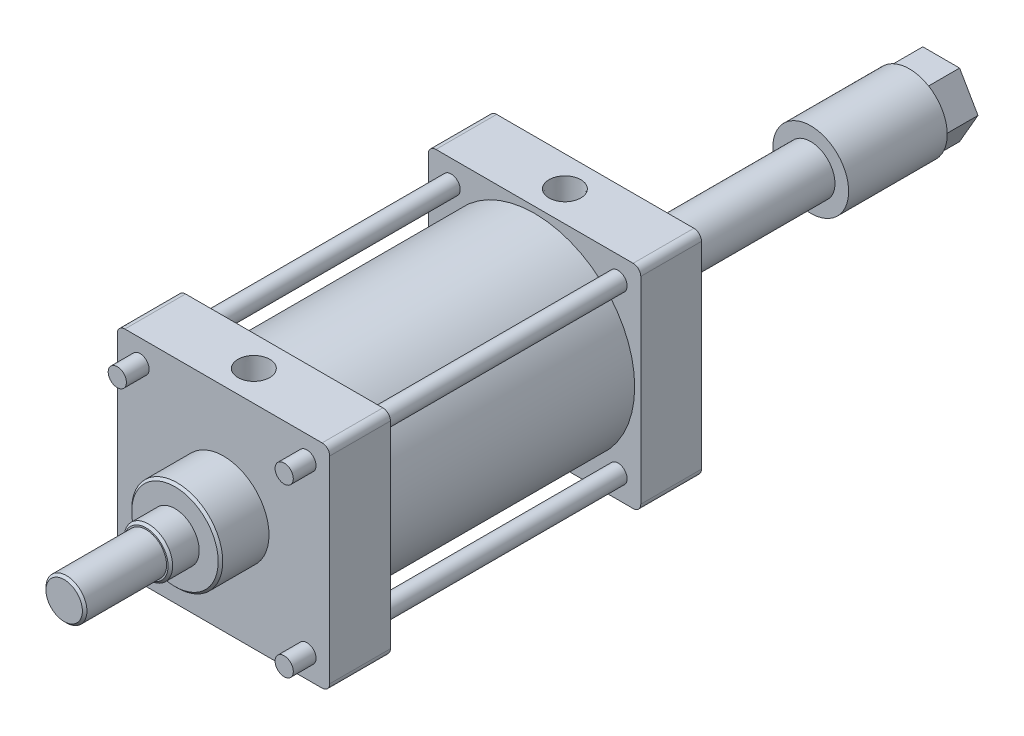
from build123d import *

# Parameters (mm, degrees)
SKETCH_1_R              = 6
EXTRUDE_1_DEPTH         = 40
SKETCH_2_R              = 66
EXTRUDE_2_DEPTH         = 165
EXTRUDE_START           = 40
SKETCH_3_R              = 6
EXTRUDE_3_DEPTH         = 40
SKETCH_4_R              = 30
EXTRUDE_4_DEPTH         = 32
EXTRUDE_START_2         = 32
SKETCH_5_R              = 30
EXTRUDE_5_DEPTH         = 32
SKETCH_6_R              = 16
EXTRUDE_6_DEPTH         = 19
SKETCH_7_R              = 13.5
EXTRUDE_7_DEPTH         = 54
CHAMFER_1_SIZE          = 1.5
CHAMFER_2_SIZE          = 1.5
SKETCH_8_R              = 25
EXTRUDE_8_DEPTH         = 10
EXTRUDE_START_3         = 100
SKETCH_9_R              = 16
EXTRUDE_9_DEPTH         = 100
SKETCH_10_R             = 25
EXTRUDE_10_DEPTH        = 65
EXTRUDE_11_DEPTH        = 21
F_1_2_RC_1_AT_2_COUNT   = 2
F_1_2_RC_1_AT_2_PITCH   = 205
EXTRUDE_12_DEPTH        = 15
EXTRUDE_12_DEPTH_BACK   = 245
SKETCH_14_R             = 6
EXTRUDE_12_2_DEPTH      = 15
EXTRUDE_12_2_DEPTH_BACK = 245
EXTRUDE_12_3_DEPTH      = 15
EXTRUDE_12_3_DEPTH_BACK = 245
EXTRUDE_12_4_DEPTH      = 15
EXTRUDE_12_4_DEPTH_BACK = 245


with BuildPart() as part:
    # Sketch 1 → Extrude 1 (new body)
    with BuildSketch(Plane.XY):
        with BuildLine():
            Line((65, 70), (-65, 70))
            ThreePointArc((-65, 70), (-68.535533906, 68.535533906), (-70, 65))
            Line((-70, 65), (-70, -65))
            ThreePointArc((-70, -65), (-68.535533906, -68.535533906), (-65, -70))
            Line((-65, -70), (65, -70))
            ThreePointArc((65, -70), (68.535533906, -68.535533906), (70, -65))
            Line((70, -65), (70, 65))
            ThreePointArc((70, 65), (68.535533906, 68.535533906), (65, 70))
        make_face()
        with Locations((55, -55)):
            Circle(SKETCH_1_R, mode=Mode.SUBTRACT)
        with Locations((-55, -55)):
            Circle(SKETCH_1_R, mode=Mode.SUBTRACT)
        with Locations((-55, 55)):
            Circle(SKETCH_1_R, mode=Mode.SUBTRACT)
        with Locations((55, 55)):
            Circle(SKETCH_1_R, mode=Mode.SUBTRACT)
    extrude(amount=EXTRUDE_1_DEPTH)

    # Sketch 2 → Extrude 2 (add)
    with BuildSketch(Plane(origin=(0, 0, 0), x_dir=(-1, 0, 0), z_dir=(0, 0, -1))):
        with Locations(Location((0, 0, 0), (0, 0, 180))):
            Circle(SKETCH_2_R)
    extrude(amount=EXTRUDE_2_DEPTH)

    # Sketch 3 → Extrude 3 (add)
    with BuildSketch(Plane(origin=(0, 0, -165), x_dir=(-1, 0, 0), z_dir=(0, 0, -1)).offset(EXTRUDE_START)):
        with BuildLine():
            Line((70, -65), (70, 65))
            ThreePointArc((70, 65), (68.535533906, 68.535533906), (65, 70))
            Line((65, 70), (-65, 70))
            ThreePointArc((-65, 70), (-68.535533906, 68.535533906), (-70, 65))
            Line((-70, 65), (-70, -65))
            ThreePointArc((-70, -65), (-68.535533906, -68.535533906), (-65, -70))
            Line((-65, -70), (65, -70))
            ThreePointArc((65, -70), (68.535533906, -68.535533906), (70, -65))
        make_face()
        with Locations(Location((55, -55, 0), (0, 0, 180))):
            Circle(SKETCH_3_R, mode=Mode.SUBTRACT)
        with Locations(Location((-55, -55, 0), (0, 0, 180))):
            Circle(SKETCH_3_R, mode=Mode.SUBTRACT)
        with Locations(Location((55, 55, 0), (0, 0, 180))):
            Circle(SKETCH_3_R, mode=Mode.SUBTRACT)
        with Locations(Location((-55, 55, 0), (0, 0, 180))):
            Circle(SKETCH_3_R, mode=Mode.SUBTRACT)
    extrude(amount=-EXTRUDE_3_DEPTH)

    # Sketch 4 → Extrude 4 (add)
    with BuildSketch(Plane.XY.offset(40)):
        Circle(SKETCH_4_R)
    extrude(amount=EXTRUDE_4_DEPTH)

    # Sketch 5 → Extrude 5 (add)
    with BuildSketch(Plane(origin=(0, 0, -205), x_dir=(-1, 0, 0), z_dir=(0, 0, -1)).offset(EXTRUDE_START_2)):
        with Locations(Location((0, 0, 0), (0, 0, 180))):
            Circle(SKETCH_5_R)
    extrude(amount=-EXTRUDE_5_DEPTH)

    # Sketch 6 → Extrude 6 (add)
    with BuildSketch(Plane.XY.offset(72)):
        Circle(SKETCH_6_R)
    extrude(amount=EXTRUDE_6_DEPTH)

    # Sketch 7 → Extrude 7 (add)
    with BuildSketch(Plane.XY.offset(91)):
        Circle(SKETCH_7_R)
    extrude(amount=EXTRUDE_7_DEPTH)

    # Chamfer 1
    chamfer_1_edges = [part.edges().sort_by_distance(p)[0] for p in [
        (-30, 0, 72),
        (-16, 0, 91),
        (-13.5, 0, 145),
    ]]
    chamfer(chamfer_1_edges, length=CHAMFER_1_SIZE)

    # Chamfer 2
    chamfer_2_edges = [part.edges().sort_by_distance(p)[0] for p in [
        (-30, 0, -237),
    ]]
    chamfer(chamfer_2_edges, length=CHAMFER_2_SIZE)

    # Sketch 8 → Extrude 8 (add)
    with BuildSketch(Plane(origin=(0, 0, -237), x_dir=(-1, 0, 0), z_dir=(0, 0, -1))):
        Circle(SKETCH_8_R)
    extrude(amount=EXTRUDE_8_DEPTH)

    # Sketch 9 → Extrude 9 (add)
    with BuildSketch(Plane(origin=(0, 0, -247), x_dir=(-1, 0, 0), z_dir=(0, 0, -1)).offset(EXTRUDE_START_3)):
        with Locations(Location((0, 0, 0), (0, 0, 180))):
            Circle(SKETCH_9_R)
    extrude(amount=-EXTRUDE_9_DEPTH)

    # Sketch 10 → Extrude 10 (add)
    with BuildSketch(Plane(origin=(0, 0, -347), x_dir=(-1, 0, 0), z_dir=(0, 0, -1))):
        Circle(SKETCH_10_R)
    extrude(amount=EXTRUDE_10_DEPTH)

    # Sketch 11 → Extrude 11 (add)
    with BuildSketch(Plane(origin=(0, 0, -412), x_dir=(-1, 0, 0), z_dir=(0, 0, -1))):
        Polygon((24.248711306, 0), (12.124355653, 21), (-12.124355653, 21), (-24.248711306, 0), (-12.124355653, -21), (12.124355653, -21), align=None)
    extrude(amount=EXTRUDE_11_DEPTH)

    # Sketch 13 → 1_2 Rc _1 (revolve, cut)
    with BuildSketch(Plane(origin=(0, 70, 20), x_dir=(0, 0, 1), z_dir=(1, 0, 0))):
        Polygon((0, 0), (0, 29.327530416), (8.75, 24.07), (8.75, 15), (10.009250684, 15), (10.4775, 0), align=None)
    f_1_2_rc_1 = revolve(axis=Axis((0, 76.35, 20), (0, -1, 0)), mode=Mode.SUBTRACT)

    # 1_2 Rc _1 at 2: 1_2 Rc _1 ×2
    with Locations(*[(0, 0, -i * F_1_2_RC_1_AT_2_PITCH) for i in range(1, F_1_2_RC_1_AT_2_COUNT)]):
        add(f_1_2_rc_1, mode=Mode.SUBTRACT)


with BuildPart() as body_2:
    # Sketch 14 → Extrude 12 (new, two sides: drawn at the far end of the back side and taken through both)
    with BuildSketch(Plane.XY.offset(40).offset(-EXTRUDE_12_DEPTH_BACK)):
        with Locations((55, 55)):
            Circle(SKETCH_14_R)
    extrude(amount=EXTRUDE_12_DEPTH + EXTRUDE_12_DEPTH_BACK)


with BuildPart() as body_3:
    # Sketch 14 → Extrude 12 2 (new, two sides: drawn at the far end of the back side and taken through both)
    with BuildSketch(Plane.XY.offset(40).offset(-EXTRUDE_12_2_DEPTH_BACK)):
        with Locations((55, -55)):
            Circle(SKETCH_14_R)
    extrude(amount=EXTRUDE_12_2_DEPTH + EXTRUDE_12_2_DEPTH_BACK)


with BuildPart() as body_4:
    # Sketch 14 → Extrude 12 3 (new, two sides: drawn at the far end of the back side and taken through both)
    with BuildSketch(Plane.XY.offset(40).offset(-EXTRUDE_12_3_DEPTH_BACK)):
        with Locations((-55, 55)):
            Circle(SKETCH_14_R)
    extrude(amount=EXTRUDE_12_3_DEPTH + EXTRUDE_12_3_DEPTH_BACK)


with BuildPart() as body_5:
    # Sketch 14 → Extrude 12 4 (new, two sides: drawn at the far end of the back side and taken through both)
    with BuildSketch(Plane.XY.offset(40).offset(-EXTRUDE_12_4_DEPTH_BACK)):
        with Locations((-55, -55)):
            Circle(SKETCH_14_R)
    extrude(amount=EXTRUDE_12_4_DEPTH + EXTRUDE_12_4_DEPTH_BACK)


solid = Compound([part.part, body_2.part, body_3.part, body_4.part, body_5.part])
